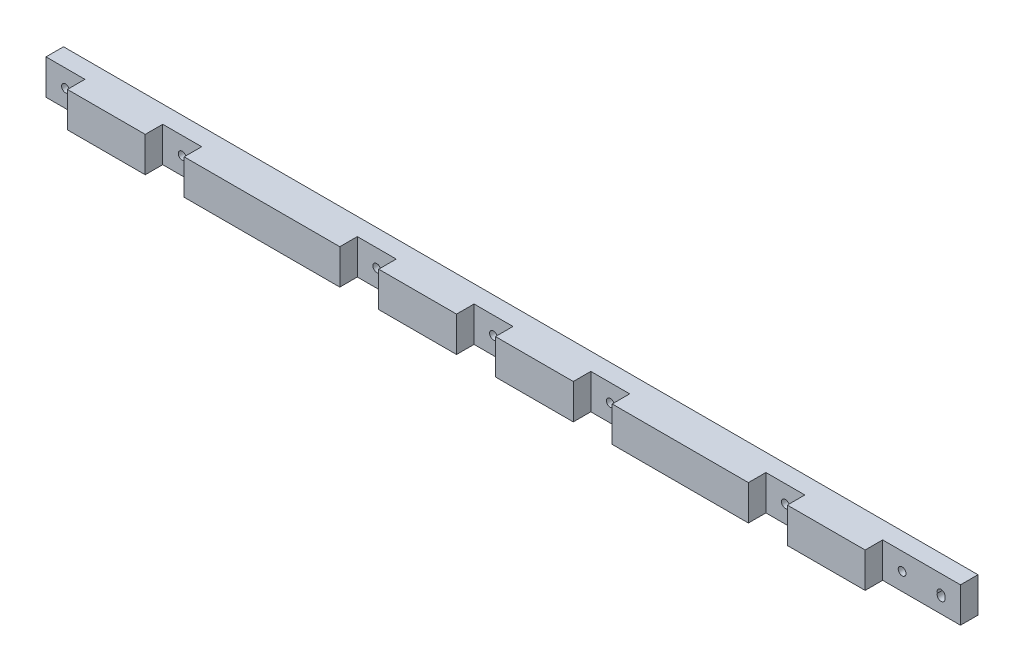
ISO-10303-21;
HEADER;
FILE_DESCRIPTION(('STEP AP214'),'2;1');
FILE_NAME('part.step','',(''),(''),'','','');
FILE_SCHEMA(('AUTOMOTIVE_DESIGN { 1 0 10303 214 1 1 1 1 }'));
ENDSEC;
DATA;
#1=APPLICATION_CONTEXT('core data for automotive mechanical design processes');
#2=APPLICATION_PROTOCOL_DEFINITION('international standard','automotive_design',2000,#1);
#3=PRODUCT_CONTEXT('',#1,'mechanical');
#4=PRODUCT('Part','Part','',(#3));
#5=PRODUCT_RELATED_PRODUCT_CATEGORY('part','',(#4));
#6=PRODUCT_DEFINITION_FORMATION('','',#4);
#7=PRODUCT_DEFINITION_CONTEXT('part definition',#1,'design');
#8=PRODUCT_DEFINITION('design','',#6,#7);
#9=PRODUCT_DEFINITION_SHAPE('','',#8);
#10=(LENGTH_UNIT() NAMED_UNIT(*) SI_UNIT(.MILLI.,.METRE.));
#11=(NAMED_UNIT(*) PLANE_ANGLE_UNIT() SI_UNIT($,.RADIAN.));
#12=(NAMED_UNIT(*) SI_UNIT($,.STERADIAN.) SOLID_ANGLE_UNIT());
#13=UNCERTAINTY_MEASURE_WITH_UNIT(LENGTH_MEASURE(1.E-05),#10,'distance_accuracy_value','');
#14=(GEOMETRIC_REPRESENTATION_CONTEXT(3) GLOBAL_UNCERTAINTY_ASSIGNED_CONTEXT((#13)) GLOBAL_UNIT_ASSIGNED_CONTEXT((#10,
#11,#12)) REPRESENTATION_CONTEXT('',''));
#15=CARTESIAN_POINT('',(0.,0.,0.));
#16=DIRECTION('',(0.,0.,1.));
#17=DIRECTION('',(1.,0.,0.));
#18=AXIS2_PLACEMENT_3D('',#15,#16,#17);
#19=CARTESIAN_POINT('',(0.,9.,9.));
#20=DIRECTION('',(0.,0.,-1.));
#21=DIRECTION('',(-1.,0.,0.));
#22=AXIS2_PLACEMENT_3D('',#19,#20,#21);
#23=PLANE('',#22);
#24=DIRECTION('',(1.,0.,0.));
#25=VECTOR('',#24,1.);
#26=CARTESIAN_POINT('',(0.,0.,9.));
#27=LINE('',#26,#25);
#28=CARTESIAN_POINT('',(195.,0.,9.));
#29=VERTEX_POINT('',#28);
#30=CARTESIAN_POINT('',(215.,0.,9.));
#31=VERTEX_POINT('',#30);
#32=EDGE_CURVE('E462',#29,#31,#27,.T.);
#33=ORIENTED_EDGE('',*,*,#32,.T.);
#34=DIRECTION('',(0.,-1.,0.));
#35=VECTOR('',#34,1.);
#36=CARTESIAN_POINT('',(215.,0.,9.));
#37=LINE('',#36,#35);
#38=CARTESIAN_POINT('',(215.,9.,9.));
#39=VERTEX_POINT('',#38);
#40=EDGE_CURVE('E252',#39,#31,#37,.T.);
#41=ORIENTED_EDGE('',*,*,#40,.F.);
#42=DIRECTION('',(-1.,0.,0.));
#43=VECTOR('',#42,1.);
#44=CARTESIAN_POINT('',(0.,9.,9.));
#45=LINE('',#44,#43);
#46=CARTESIAN_POINT('',(195.,9.,9.));
#47=VERTEX_POINT('',#46);
#48=EDGE_CURVE('E463',#39,#47,#45,.T.);
#49=ORIENTED_EDGE('',*,*,#48,.T.);
#50=DIRECTION('',(0.,1.,0.));
#51=VECTOR('',#50,1.);
#52=CARTESIAN_POINT('',(195.,0.,9.));
#53=LINE('',#52,#51);
#54=EDGE_CURVE('E280',#29,#47,#53,.T.);
#55=ORIENTED_EDGE('',*,*,#54,.F.);
#56=EDGE_LOOP('',(#33,#41,#49,#55));
#57=FACE_BOUND('',#56,.T.);
#58=ADVANCED_FACE('F31',(#57),#23,.F.);
#59=CARTESIAN_POINT('',(150.,0.,9.));
#60=VERTEX_POINT('',#59);
#61=CARTESIAN_POINT('',(185.,0.,9.));
#62=VERTEX_POINT('',#61);
#63=EDGE_CURVE('E563',#60,#62,#27,.T.);
#64=ORIENTED_EDGE('',*,*,#63,.T.);
#65=DIRECTION('',(0.,-1.,0.));
#66=VECTOR('',#65,1.);
#67=CARTESIAN_POINT('',(185.,0.,9.));
#68=LINE('',#67,#66);
#69=CARTESIAN_POINT('',(185.,9.,9.));
#70=VERTEX_POINT('',#69);
#71=EDGE_CURVE('E273',#70,#62,#68,.T.);
#72=ORIENTED_EDGE('',*,*,#71,.F.);
#73=CARTESIAN_POINT('',(150.,9.,9.));
#74=VERTEX_POINT('',#73);
#75=EDGE_CURVE('E466',#70,#74,#45,.T.);
#76=ORIENTED_EDGE('',*,*,#75,.T.);
#77=DIRECTION('',(0.,1.,0.));
#78=VECTOR('',#77,1.);
#79=CARTESIAN_POINT('',(150.,0.,9.));
#80=LINE('',#79,#78);
#81=EDGE_CURVE('E311',#60,#74,#80,.T.);
#82=ORIENTED_EDGE('',*,*,#81,.F.);
#83=EDGE_LOOP('',(#64,#72,#76,#82));
#84=FACE_BOUND('',#83,.T.);
#85=ADVANCED_FACE('F590',(#84),#23,.F.);
#86=CARTESIAN_POINT('',(120.,0.,9.));
#87=VERTEX_POINT('',#86);
#88=CARTESIAN_POINT('',(140.,0.,9.));
#89=VERTEX_POINT('',#88);
#90=EDGE_CURVE('E557',#87,#89,#27,.T.);
#91=ORIENTED_EDGE('',*,*,#90,.T.);
#92=DIRECTION('',(0.,-1.,0.));
#93=VECTOR('',#92,1.);
#94=CARTESIAN_POINT('',(140.,0.,9.));
#95=LINE('',#94,#93);
#96=CARTESIAN_POINT('',(140.,9.,9.));
#97=VERTEX_POINT('',#96);
#98=EDGE_CURVE('E304',#97,#89,#95,.T.);
#99=ORIENTED_EDGE('',*,*,#98,.F.);
#100=CARTESIAN_POINT('',(120.,9.,9.));
#101=VERTEX_POINT('',#100);
#102=EDGE_CURVE('E591',#97,#101,#45,.T.);
#103=ORIENTED_EDGE('',*,*,#102,.T.);
#104=DIRECTION('',(0.,1.,0.));
#105=VECTOR('',#104,1.);
#106=CARTESIAN_POINT('',(120.,0.,9.));
#107=LINE('',#106,#105);
#108=EDGE_CURVE('E344',#87,#101,#107,.T.);
#109=ORIENTED_EDGE('',*,*,#108,.F.);
#110=EDGE_LOOP('',(#91,#99,#103,#109));
#111=FACE_BOUND('',#110,.T.);
#112=ADVANCED_FACE('F604',(#111),#23,.F.);
#113=CARTESIAN_POINT('',(90.,0.,9.));
#114=VERTEX_POINT('',#113);
#115=CARTESIAN_POINT('',(110.,0.,9.));
#116=VERTEX_POINT('',#115);
#117=EDGE_CURVE('E555',#114,#116,#27,.T.);
#118=ORIENTED_EDGE('',*,*,#117,.T.);
#119=DIRECTION('',(0.,-1.,0.));
#120=VECTOR('',#119,1.);
#121=CARTESIAN_POINT('',(110.,0.,9.));
#122=LINE('',#121,#120);
#123=CARTESIAN_POINT('',(110.,9.,9.));
#124=VERTEX_POINT('',#123);
#125=EDGE_CURVE('E337',#124,#116,#122,.T.);
#126=ORIENTED_EDGE('',*,*,#125,.F.);
#127=CARTESIAN_POINT('',(90.,9.,9.));
#128=VERTEX_POINT('',#127);
#129=EDGE_CURVE('E606',#124,#128,#45,.T.);
#130=ORIENTED_EDGE('',*,*,#129,.T.);
#131=DIRECTION('',(0.,1.,0.));
#132=VECTOR('',#131,1.);
#133=CARTESIAN_POINT('',(90.,9.,9.));
#134=LINE('',#133,#132);
#135=EDGE_CURVE('E377',#114,#128,#134,.T.);
#136=ORIENTED_EDGE('',*,*,#135,.F.);
#137=EDGE_LOOP('',(#118,#126,#130,#136));
#138=FACE_BOUND('',#137,.T.);
#139=ADVANCED_FACE('F608',(#138),#23,.F.);
#140=CARTESIAN_POINT('',(40.,0.,9.));
#141=VERTEX_POINT('',#140);
#142=CARTESIAN_POINT('',(80.,0.,9.));
#143=VERTEX_POINT('',#142);
#144=EDGE_CURVE('E461',#141,#143,#27,.T.);
#145=ORIENTED_EDGE('',*,*,#144,.T.);
#146=DIRECTION('',(0.,-1.,0.));
#147=VECTOR('',#146,1.);
#148=CARTESIAN_POINT('',(80.,9.,9.));
#149=LINE('',#148,#147);
#150=CARTESIAN_POINT('',(80.,9.,9.));
#151=VERTEX_POINT('',#150);
#152=EDGE_CURVE('E370',#151,#143,#149,.T.);
#153=ORIENTED_EDGE('',*,*,#152,.F.);
#154=CARTESIAN_POINT('',(40.,9.,9.));
#155=VERTEX_POINT('',#154);
#156=EDGE_CURVE('E545',#151,#155,#45,.T.);
#157=ORIENTED_EDGE('',*,*,#156,.T.);
#158=DIRECTION('',(0.,1.,0.));
#159=VECTOR('',#158,1.);
#160=CARTESIAN_POINT('',(40.,0.,9.));
#161=LINE('',#160,#159);
#162=EDGE_CURVE('E410',#141,#155,#161,.T.);
#163=ORIENTED_EDGE('',*,*,#162,.F.);
#164=EDGE_LOOP('',(#145,#153,#157,#163));
#165=FACE_BOUND('',#164,.T.);
#166=ADVANCED_FACE('F552',(#165),#23,.F.);
#167=CARTESIAN_POINT('',(10.,0.,9.));
#168=VERTEX_POINT('',#167);
#169=CARTESIAN_POINT('',(30.,0.,9.));
#170=VERTEX_POINT('',#169);
#171=EDGE_CURVE('E457',#168,#170,#27,.T.);
#172=ORIENTED_EDGE('',*,*,#171,.T.);
#173=DIRECTION('',(0.,-1.,0.));
#174=VECTOR('',#173,1.);
#175=CARTESIAN_POINT('',(30.,0.,9.));
#176=LINE('',#175,#174);
#177=CARTESIAN_POINT('',(30.,9.,9.));
#178=VERTEX_POINT('',#177);
#179=EDGE_CURVE('E403',#178,#170,#176,.T.);
#180=ORIENTED_EDGE('',*,*,#179,.F.);
#181=CARTESIAN_POINT('',(10.,9.,9.));
#182=VERTEX_POINT('',#181);
#183=EDGE_CURVE('E460',#178,#182,#45,.T.);
#184=ORIENTED_EDGE('',*,*,#183,.T.);
#185=DIRECTION('',(0.,1.,0.));
#186=VECTOR('',#185,1.);
#187=CARTESIAN_POINT('',(10.,0.,9.));
#188=LINE('',#187,#186);
#189=EDGE_CURVE('E436',#168,#182,#188,.T.);
#190=ORIENTED_EDGE('',*,*,#189,.F.);
#191=EDGE_LOOP('',(#172,#180,#184,#190));
#192=FACE_BOUND('',#191,.T.);
#193=ADVANCED_FACE('F534',(#192),#23,.F.);
#194=CARTESIAN_POINT('',(0.,0.,9.));
#195=DIRECTION('',(1.,0.,0.));
#196=DIRECTION('',(0.,0.,-1.));
#197=AXIS2_PLACEMENT_3D('',#194,#195,#196);
#198=PLANE('',#197);
#199=DIRECTION('',(0.,0.,-1.));
#200=VECTOR('',#199,1.);
#201=CARTESIAN_POINT('',(0.,0.,9.));
#202=LINE('',#201,#200);
#203=CARTESIAN_POINT('',(0.,0.,4.5));
#204=VERTEX_POINT('',#203);
#205=CARTESIAN_POINT('',(0.,0.,0.));
#206=VERTEX_POINT('',#205);
#207=EDGE_CURVE('E483',#204,#206,#202,.T.);
#208=ORIENTED_EDGE('',*,*,#207,.F.);
#209=DIRECTION('',(0.,-1.,0.));
#210=VECTOR('',#209,1.);
#211=CARTESIAN_POINT('',(0.,0.,4.5));
#212=LINE('',#211,#210);
#213=CARTESIAN_POINT('',(0.,9.,4.5));
#214=VERTEX_POINT('',#213);
#215=EDGE_CURVE('E439',#214,#204,#212,.T.);
#216=ORIENTED_EDGE('',*,*,#215,.F.);
#217=DIRECTION('',(0.,0.,-1.));
#218=VECTOR('',#217,1.);
#219=CARTESIAN_POINT('',(0.,9.,9.));
#220=LINE('',#219,#218);
#221=CARTESIAN_POINT('',(0.,9.,0.));
#222=VERTEX_POINT('',#221);
#223=EDGE_CURVE('E465',#214,#222,#220,.T.);
#224=ORIENTED_EDGE('',*,*,#223,.T.);
#225=DIRECTION('',(0.,-1.,0.));
#226=VECTOR('',#225,1.);
#227=CARTESIAN_POINT('',(0.,0.,0.));
#228=LINE('',#227,#226);
#229=EDGE_CURVE('E455',#222,#206,#228,.T.);
#230=ORIENTED_EDGE('',*,*,#229,.T.);
#231=EDGE_LOOP('',(#208,#216,#224,#230));
#232=FACE_BOUND('',#231,.T.);
#233=ADVANCED_FACE('F33',(#232),#198,.F.);
#234=CARTESIAN_POINT('',(0.,0.,9.));
#235=DIRECTION('',(0.,1.,0.));
#236=DIRECTION('',(0.,0.,1.));
#237=AXIS2_PLACEMENT_3D('',#234,#235,#236);
#238=PLANE('',#237);
#239=DIRECTION('',(0.,0.,-1.));
#240=VECTOR('',#239,1.);
#241=CARTESIAN_POINT('',(235.,0.,9.));
#242=LINE('',#241,#240);
#243=CARTESIAN_POINT('',(235.,0.,4.5));
#244=VERTEX_POINT('',#243);
#245=CARTESIAN_POINT('',(235.,0.,0.));
#246=VERTEX_POINT('',#245);
#247=EDGE_CURVE('E481',#244,#246,#242,.T.);
#248=ORIENTED_EDGE('',*,*,#247,.F.);
#249=DIRECTION('',(1.,0.,0.));
#250=VECTOR('',#249,1.);
#251=CARTESIAN_POINT('',(215.,0.,4.5));
#252=LINE('',#251,#250);
#253=CARTESIAN_POINT('',(215.,0.,4.5));
#254=VERTEX_POINT('',#253);
#255=EDGE_CURVE('E258',#254,#244,#252,.T.);
#256=ORIENTED_EDGE('',*,*,#255,.F.);
#257=DIRECTION('',(0.,0.,1.));
#258=VECTOR('',#257,1.);
#259=CARTESIAN_POINT('',(215.,0.,4.5));
#260=LINE('',#259,#258);
#261=EDGE_CURVE('E263',#254,#31,#260,.T.);
#262=ORIENTED_EDGE('',*,*,#261,.T.);
#263=ORIENTED_EDGE('',*,*,#32,.F.);
#264=DIRECTION('',(0.,0.,1.));
#265=VECTOR('',#264,1.);
#266=CARTESIAN_POINT('',(195.,0.,4.5));
#267=LINE('',#266,#265);
#268=CARTESIAN_POINT('',(195.,0.,4.5));
#269=VERTEX_POINT('',#268);
#270=EDGE_CURVE('E54',#269,#29,#267,.T.);
#271=ORIENTED_EDGE('',*,*,#270,.F.);
#272=DIRECTION('',(1.,0.,0.));
#273=VECTOR('',#272,1.);
#274=CARTESIAN_POINT('',(185.,0.,4.5));
#275=LINE('',#274,#273);
#276=CARTESIAN_POINT('',(185.,0.,4.5));
#277=VERTEX_POINT('',#276);
#278=EDGE_CURVE('E279',#277,#269,#275,.T.);
#279=ORIENTED_EDGE('',*,*,#278,.F.);
#280=DIRECTION('',(0.,0.,1.));
#281=VECTOR('',#280,1.);
#282=CARTESIAN_POINT('',(185.,0.,4.5));
#283=LINE('',#282,#281);
#284=EDGE_CURVE('E289',#277,#62,#283,.T.);
#285=ORIENTED_EDGE('',*,*,#284,.T.);
#286=ORIENTED_EDGE('',*,*,#63,.F.);
#287=DIRECTION('',(0.,0.,1.));
#288=VECTOR('',#287,1.);
#289=CARTESIAN_POINT('',(150.,0.,4.5));
#290=LINE('',#289,#288);
#291=CARTESIAN_POINT('',(150.,0.,4.5));
#292=VERTEX_POINT('',#291);
#293=EDGE_CURVE('E330',#292,#60,#290,.T.);
#294=ORIENTED_EDGE('',*,*,#293,.F.);
#295=DIRECTION('',(1.,0.,0.));
#296=VECTOR('',#295,1.);
#297=CARTESIAN_POINT('',(140.,0.,4.5));
#298=LINE('',#297,#296);
#299=CARTESIAN_POINT('',(140.,0.,4.5));
#300=VERTEX_POINT('',#299);
#301=EDGE_CURVE('E310',#300,#292,#298,.T.);
#302=ORIENTED_EDGE('',*,*,#301,.F.);
#303=DIRECTION('',(0.,0.,1.));
#304=VECTOR('',#303,1.);
#305=CARTESIAN_POINT('',(140.,0.,4.5));
#306=LINE('',#305,#304);
#307=EDGE_CURVE('E320',#300,#89,#306,.T.);
#308=ORIENTED_EDGE('',*,*,#307,.T.);
#309=ORIENTED_EDGE('',*,*,#90,.F.);
#310=DIRECTION('',(0.,0.,1.));
#311=VECTOR('',#310,1.);
#312=CARTESIAN_POINT('',(120.,0.,4.5));
#313=LINE('',#312,#311);
#314=CARTESIAN_POINT('',(120.,0.,4.5));
#315=VERTEX_POINT('',#314);
#316=EDGE_CURVE('E363',#315,#87,#313,.T.);
#317=ORIENTED_EDGE('',*,*,#316,.F.);
#318=DIRECTION('',(1.,0.,0.));
#319=VECTOR('',#318,1.);
#320=CARTESIAN_POINT('',(110.,0.,4.5));
#321=LINE('',#320,#319);
#322=CARTESIAN_POINT('',(110.,0.,4.5));
#323=VERTEX_POINT('',#322);
#324=EDGE_CURVE('E343',#323,#315,#321,.T.);
#325=ORIENTED_EDGE('',*,*,#324,.F.);
#326=DIRECTION('',(0.,0.,1.));
#327=VECTOR('',#326,1.);
#328=CARTESIAN_POINT('',(110.,0.,4.5));
#329=LINE('',#328,#327);
#330=EDGE_CURVE('E353',#323,#116,#329,.T.);
#331=ORIENTED_EDGE('',*,*,#330,.T.);
#332=ORIENTED_EDGE('',*,*,#117,.F.);
#333=DIRECTION('',(0.,0.,1.));
#334=VECTOR('',#333,1.);
#335=CARTESIAN_POINT('',(90.,0.,4.5));
#336=LINE('',#335,#334);
#337=CARTESIAN_POINT('',(90.,0.,4.5));
#338=VERTEX_POINT('',#337);
#339=EDGE_CURVE('E396',#338,#114,#336,.T.);
#340=ORIENTED_EDGE('',*,*,#339,.F.);
#341=DIRECTION('',(1.,0.,0.));
#342=VECTOR('',#341,1.);
#343=CARTESIAN_POINT('',(80.,0.,4.5));
#344=LINE('',#343,#342);
#345=CARTESIAN_POINT('',(80.,0.,4.5));
#346=VERTEX_POINT('',#345);
#347=EDGE_CURVE('E376',#346,#338,#344,.T.);
#348=ORIENTED_EDGE('',*,*,#347,.F.);
#349=DIRECTION('',(0.,0.,1.));
#350=VECTOR('',#349,1.);
#351=CARTESIAN_POINT('',(80.,0.,4.5));
#352=LINE('',#351,#350);
#353=EDGE_CURVE('E386',#346,#143,#352,.T.);
#354=ORIENTED_EDGE('',*,*,#353,.T.);
#355=ORIENTED_EDGE('',*,*,#144,.F.);
#356=DIRECTION('',(0.,0.,1.));
#357=VECTOR('',#356,1.);
#358=CARTESIAN_POINT('',(40.,0.,4.5));
#359=LINE('',#358,#357);
#360=CARTESIAN_POINT('',(40.,0.,4.5));
#361=VERTEX_POINT('',#360);
#362=EDGE_CURVE('E429',#361,#141,#359,.T.);
#363=ORIENTED_EDGE('',*,*,#362,.F.);
#364=DIRECTION('',(1.,0.,0.));
#365=VECTOR('',#364,1.);
#366=CARTESIAN_POINT('',(30.,0.,4.5));
#367=LINE('',#366,#365);
#368=CARTESIAN_POINT('',(30.,0.,4.5));
#369=VERTEX_POINT('',#368);
#370=EDGE_CURVE('E409',#369,#361,#367,.T.);
#371=ORIENTED_EDGE('',*,*,#370,.F.);
#372=DIRECTION('',(0.,0.,1.));
#373=VECTOR('',#372,1.);
#374=CARTESIAN_POINT('',(30.,0.,4.5));
#375=LINE('',#374,#373);
#376=EDGE_CURVE('E419',#369,#170,#375,.T.);
#377=ORIENTED_EDGE('',*,*,#376,.T.);
#378=ORIENTED_EDGE('',*,*,#171,.F.);
#379=DIRECTION('',(0.,0.,1.));
#380=VECTOR('',#379,1.);
#381=CARTESIAN_POINT('',(10.,0.,4.5));
#382=LINE('',#381,#380);
#383=CARTESIAN_POINT('',(10.,0.,4.5));
#384=VERTEX_POINT('',#383);
#385=EDGE_CURVE('E449',#384,#168,#382,.T.);
#386=ORIENTED_EDGE('',*,*,#385,.F.);
#387=DIRECTION('',(1.,0.,0.));
#388=VECTOR('',#387,1.);
#389=CARTESIAN_POINT('',(0.,0.,4.5));
#390=LINE('',#389,#388);
#391=EDGE_CURVE('E441',#204,#384,#390,.T.);
#392=ORIENTED_EDGE('',*,*,#391,.F.);
#393=ORIENTED_EDGE('',*,*,#207,.T.);
#394=DIRECTION('',(1.,0.,0.));
#395=VECTOR('',#394,1.);
#396=CARTESIAN_POINT('',(0.,0.,0.));
#397=LINE('',#396,#395);
#398=EDGE_CURVE('E469',#206,#246,#397,.T.);
#399=ORIENTED_EDGE('',*,*,#398,.T.);
#400=EDGE_LOOP('',(#248,#256,#262,#263,#271,#279,#285,#286,#294,#302,#308,#309,#317,#325,#331,
#332,#340,#348,#354,#355,#363,#371,#377,#378,#386,#392,#393,#399));
#401=FACE_BOUND('',#400,.T.);
#402=ADVANCED_FACE('F523',(#401),#238,.F.);
#403=CARTESIAN_POINT('',(235.,0.,9.));
#404=DIRECTION('',(-1.,0.,0.));
#405=DIRECTION('',(0.,0.,1.));
#406=AXIS2_PLACEMENT_3D('',#403,#404,#405);
#407=PLANE('',#406);
#408=DIRECTION('',(0.,0.,-1.));
#409=VECTOR('',#408,1.);
#410=CARTESIAN_POINT('',(235.,9.,9.));
#411=LINE('',#410,#409);
#412=CARTESIAN_POINT('',(235.,9.,4.5));
#413=VERTEX_POINT('',#412);
#414=CARTESIAN_POINT('',(235.,9.,0.));
#415=VERTEX_POINT('',#414);
#416=EDGE_CURVE('E479',#413,#415,#411,.T.);
#417=ORIENTED_EDGE('',*,*,#416,.F.);
#418=DIRECTION('',(0.,1.,0.));
#419=VECTOR('',#418,1.);
#420=CARTESIAN_POINT('',(235.,0.,4.5));
#421=LINE('',#420,#419);
#422=EDGE_CURVE('E242',#244,#413,#421,.T.);
#423=ORIENTED_EDGE('',*,*,#422,.F.);
#424=ORIENTED_EDGE('',*,*,#247,.T.);
#425=DIRECTION('',(0.,1.,0.));
#426=VECTOR('',#425,1.);
#427=CARTESIAN_POINT('',(235.,0.,0.));
#428=LINE('',#427,#426);
#429=EDGE_CURVE('E472',#246,#415,#428,.T.);
#430=ORIENTED_EDGE('',*,*,#429,.T.);
#431=EDGE_LOOP('',(#417,#423,#424,#430));
#432=FACE_BOUND('',#431,.T.);
#433=ADVANCED_FACE('F519',(#432),#407,.F.);
#434=CARTESIAN_POINT('',(0.,9.,9.));
#435=DIRECTION('',(0.,-1.,0.));
#436=DIRECTION('',(0.,0.,-1.));
#437=AXIS2_PLACEMENT_3D('',#434,#435,#436);
#438=PLANE('',#437);
#439=DIRECTION('',(-1.,0.,0.));
#440=VECTOR('',#439,1.);
#441=CARTESIAN_POINT('',(215.,9.,4.5));
#442=LINE('',#441,#440);
#443=CARTESIAN_POINT('',(215.,9.,4.5));
#444=VERTEX_POINT('',#443);
#445=EDGE_CURVE('E260',#413,#444,#442,.T.);
#446=ORIENTED_EDGE('',*,*,#445,.F.);
#447=ORIENTED_EDGE('',*,*,#416,.T.);
#448=DIRECTION('',(-1.,0.,0.));
#449=VECTOR('',#448,1.);
#450=CARTESIAN_POINT('',(0.,9.,0.));
#451=LINE('',#450,#449);
#452=EDGE_CURVE('E475',#415,#222,#451,.T.);
#453=ORIENTED_EDGE('',*,*,#452,.T.);
#454=ORIENTED_EDGE('',*,*,#223,.F.);
#455=DIRECTION('',(-1.,0.,0.));
#456=VECTOR('',#455,1.);
#457=CARTESIAN_POINT('',(0.,9.,4.5));
#458=LINE('',#457,#456);
#459=CARTESIAN_POINT('',(10.,9.,4.5));
#460=VERTEX_POINT('',#459);
#461=EDGE_CURVE('E447',#460,#214,#458,.T.);
#462=ORIENTED_EDGE('',*,*,#461,.F.);
#463=DIRECTION('',(0.,0.,1.));
#464=VECTOR('',#463,1.);
#465=CARTESIAN_POINT('',(10.,9.,4.5));
#466=LINE('',#465,#464);
#467=EDGE_CURVE('E452',#460,#182,#466,.T.);
#468=ORIENTED_EDGE('',*,*,#467,.T.);
#469=ORIENTED_EDGE('',*,*,#183,.F.);
#470=DIRECTION('',(0.,0.,1.));
#471=VECTOR('',#470,1.);
#472=CARTESIAN_POINT('',(30.,9.,4.5));
#473=LINE('',#472,#471);
#474=CARTESIAN_POINT('',(30.,9.,4.5));
#475=VERTEX_POINT('',#474);
#476=EDGE_CURVE('E423',#475,#178,#473,.T.);
#477=ORIENTED_EDGE('',*,*,#476,.F.);
#478=DIRECTION('',(-1.,0.,0.));
#479=VECTOR('',#478,1.);
#480=CARTESIAN_POINT('',(30.,9.,4.5));
#481=LINE('',#480,#479);
#482=CARTESIAN_POINT('',(40.,9.,4.5));
#483=VERTEX_POINT('',#482);
#484=EDGE_CURVE('E416',#483,#475,#481,.T.);
#485=ORIENTED_EDGE('',*,*,#484,.F.);
#486=DIRECTION('',(0.,0.,1.));
#487=VECTOR('',#486,1.);
#488=CARTESIAN_POINT('',(40.,9.,4.5));
#489=LINE('',#488,#487);
#490=EDGE_CURVE('E426',#483,#155,#489,.T.);
#491=ORIENTED_EDGE('',*,*,#490,.T.);
#492=ORIENTED_EDGE('',*,*,#156,.F.);
#493=DIRECTION('',(0.,0.,1.));
#494=VECTOR('',#493,1.);
#495=CARTESIAN_POINT('',(80.,9.,4.5));
#496=LINE('',#495,#494);
#497=CARTESIAN_POINT('',(80.,9.,4.5));
#498=VERTEX_POINT('',#497);
#499=EDGE_CURVE('E390',#498,#151,#496,.T.);
#500=ORIENTED_EDGE('',*,*,#499,.F.);
#501=DIRECTION('',(-1.,0.,0.));
#502=VECTOR('',#501,1.);
#503=CARTESIAN_POINT('',(80.,9.,4.5));
#504=LINE('',#503,#502);
#505=CARTESIAN_POINT('',(90.,9.,4.5));
#506=VERTEX_POINT('',#505);
#507=EDGE_CURVE('E383',#506,#498,#504,.T.);
#508=ORIENTED_EDGE('',*,*,#507,.F.);
#509=DIRECTION('',(0.,0.,1.));
#510=VECTOR('',#509,1.);
#511=CARTESIAN_POINT('',(90.,9.,4.5));
#512=LINE('',#511,#510);
#513=EDGE_CURVE('E393',#506,#128,#512,.T.);
#514=ORIENTED_EDGE('',*,*,#513,.T.);
#515=ORIENTED_EDGE('',*,*,#129,.F.);
#516=DIRECTION('',(0.,0.,1.));
#517=VECTOR('',#516,1.);
#518=CARTESIAN_POINT('',(110.,9.,4.5));
#519=LINE('',#518,#517);
#520=CARTESIAN_POINT('',(110.,9.,4.5));
#521=VERTEX_POINT('',#520);
#522=EDGE_CURVE('E357',#521,#124,#519,.T.);
#523=ORIENTED_EDGE('',*,*,#522,.F.);
#524=DIRECTION('',(-1.,0.,0.));
#525=VECTOR('',#524,1.);
#526=CARTESIAN_POINT('',(110.,9.,4.5));
#527=LINE('',#526,#525);
#528=CARTESIAN_POINT('',(120.,9.,4.5));
#529=VERTEX_POINT('',#528);
#530=EDGE_CURVE('E350',#529,#521,#527,.T.);
#531=ORIENTED_EDGE('',*,*,#530,.F.);
#532=DIRECTION('',(0.,0.,1.));
#533=VECTOR('',#532,1.);
#534=CARTESIAN_POINT('',(120.,9.,4.5));
#535=LINE('',#534,#533);
#536=EDGE_CURVE('E360',#529,#101,#535,.T.);
#537=ORIENTED_EDGE('',*,*,#536,.T.);
#538=ORIENTED_EDGE('',*,*,#102,.F.);
#539=DIRECTION('',(0.,0.,1.));
#540=VECTOR('',#539,1.);
#541=CARTESIAN_POINT('',(140.,9.,4.5));
#542=LINE('',#541,#540);
#543=CARTESIAN_POINT('',(140.,9.,4.5));
#544=VERTEX_POINT('',#543);
#545=EDGE_CURVE('E324',#544,#97,#542,.T.);
#546=ORIENTED_EDGE('',*,*,#545,.F.);
#547=DIRECTION('',(-1.,0.,0.));
#548=VECTOR('',#547,1.);
#549=CARTESIAN_POINT('',(140.,9.,4.5));
#550=LINE('',#549,#548);
#551=CARTESIAN_POINT('',(150.,9.,4.5));
#552=VERTEX_POINT('',#551);
#553=EDGE_CURVE('E317',#552,#544,#550,.T.);
#554=ORIENTED_EDGE('',*,*,#553,.F.);
#555=DIRECTION('',(0.,0.,1.));
#556=VECTOR('',#555,1.);
#557=CARTESIAN_POINT('',(150.,9.,4.5));
#558=LINE('',#557,#556);
#559=EDGE_CURVE('E327',#552,#74,#558,.T.);
#560=ORIENTED_EDGE('',*,*,#559,.T.);
#561=ORIENTED_EDGE('',*,*,#75,.F.);
#562=DIRECTION('',(0.,0.,1.));
#563=VECTOR('',#562,1.);
#564=CARTESIAN_POINT('',(185.,9.,4.5));
#565=LINE('',#564,#563);
#566=CARTESIAN_POINT('',(185.,9.,4.5));
#567=VERTEX_POINT('',#566);
#568=EDGE_CURVE('E292',#567,#70,#565,.T.);
#569=ORIENTED_EDGE('',*,*,#568,.F.);
#570=DIRECTION('',(-1.,0.,0.));
#571=VECTOR('',#570,1.);
#572=CARTESIAN_POINT('',(185.,9.,4.5));
#573=LINE('',#572,#571);
#574=CARTESIAN_POINT('',(195.,9.,4.5));
#575=VERTEX_POINT('',#574);
#576=EDGE_CURVE('E286',#575,#567,#573,.T.);
#577=ORIENTED_EDGE('',*,*,#576,.F.);
#578=DIRECTION('',(0.,0.,1.));
#579=VECTOR('',#578,1.);
#580=CARTESIAN_POINT('',(195.,9.,4.5));
#581=LINE('',#580,#579);
#582=EDGE_CURVE('E295',#575,#47,#581,.T.);
#583=ORIENTED_EDGE('',*,*,#582,.T.);
#584=ORIENTED_EDGE('',*,*,#48,.F.);
#585=DIRECTION('',(0.,0.,1.));
#586=VECTOR('',#585,1.);
#587=CARTESIAN_POINT('',(215.,9.,4.5));
#588=LINE('',#587,#586);
#589=EDGE_CURVE('E265',#444,#39,#588,.T.);
#590=ORIENTED_EDGE('',*,*,#589,.F.);
#591=EDGE_LOOP('',(#446,#447,#453,#454,#462,#468,#469,#477,#485,#491,#492,#500,#508,#514,#515,
#523,#531,#537,#538,#546,#554,#560,#561,#569,#577,#583,#584,#590));
#592=FACE_BOUND('',#591,.T.);
#593=ADVANCED_FACE('F489',(#592),#438,.F.);
#594=CARTESIAN_POINT('',(0.,9.,0.));
#595=DIRECTION('',(0.,0.,-1.));
#596=DIRECTION('',(-1.,0.,0.));
#597=AXIS2_PLACEMENT_3D('',#594,#595,#596);
#598=PLANE('',#597);
#599=CARTESIAN_POINT('',(230.,3.8157537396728,0.));
#600=DIRECTION('',(0.,0.,1.));
#601=DIRECTION('',(1.,0.,0.));
#602=AXIS2_PLACEMENT_3D('',#599,#600,#601);
#603=CIRCLE('',#602,0.999999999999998);
#604=CARTESIAN_POINT('',(229.060344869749,4.1578768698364,0.));
#605=VERTEX_POINT('',#604);
#606=CARTESIAN_POINT('',(230.939655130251,4.1578768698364,0.));
#607=VERTEX_POINT('',#606);
#608=EDGE_CURVE('E46',#605,#607,#603,.T.);
#609=ORIENTED_EDGE('',*,*,#608,.T.);
#610=CARTESIAN_POINT('',(230.,4.5,0.));
#611=DIRECTION('',(0.,0.,1.));
#612=DIRECTION('',(1.,0.,0.));
#613=AXIS2_PLACEMENT_3D('',#610,#611,#612);
#614=CIRCLE('',#613,0.999999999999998);
#615=EDGE_CURVE('E238',#607,#605,#614,.T.);
#616=ORIENTED_EDGE('',*,*,#615,.T.);
#617=EDGE_LOOP('',(#609,#616));
#618=FACE_BOUND('',#617,.T.);
#619=CARTESIAN_POINT('',(220.,4.5,0.));
#620=DIRECTION('',(0.,0.,1.));
#621=DIRECTION('',(1.,0.,0.));
#622=AXIS2_PLACEMENT_3D('',#619,#620,#621);
#623=CIRCLE('',#622,0.999999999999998);
#624=CARTESIAN_POINT('',(221.,4.5,0.));
#625=VERTEX_POINT('',#624);
#626=EDGE_CURVE('E249',#625,#625,#623,.T.);
#627=ORIENTED_EDGE('',*,*,#626,.T.);
#628=EDGE_LOOP('',(#627));
#629=FACE_BOUND('',#628,.T.);
#630=CARTESIAN_POINT('',(190.,4.5,0.));
#631=DIRECTION('',(0.,0.,1.));
#632=DIRECTION('',(1.,0.,0.));
#633=AXIS2_PLACEMENT_3D('',#630,#631,#632);
#634=CIRCLE('',#633,0.999999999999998);
#635=CARTESIAN_POINT('',(191.,4.5,0.));
#636=VERTEX_POINT('',#635);
#637=EDGE_CURVE('E270',#636,#636,#634,.T.);
#638=ORIENTED_EDGE('',*,*,#637,.T.);
#639=EDGE_LOOP('',(#638));
#640=FACE_BOUND('',#639,.T.);
#641=CARTESIAN_POINT('',(145.,4.5,0.));
#642=DIRECTION('',(0.,0.,1.));
#643=DIRECTION('',(1.,0.,0.));
#644=AXIS2_PLACEMENT_3D('',#641,#642,#643);
#645=CIRCLE('',#644,0.999999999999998);
#646=CARTESIAN_POINT('',(146.,4.5,0.));
#647=VERTEX_POINT('',#646);
#648=EDGE_CURVE('E301',#647,#647,#645,.T.);
#649=ORIENTED_EDGE('',*,*,#648,.T.);
#650=EDGE_LOOP('',(#649));
#651=FACE_BOUND('',#650,.T.);
#652=CARTESIAN_POINT('',(115.,4.5,0.));
#653=DIRECTION('',(0.,0.,1.));
#654=DIRECTION('',(1.,0.,0.));
#655=AXIS2_PLACEMENT_3D('',#652,#653,#654);
#656=CIRCLE('',#655,0.999999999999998);
#657=CARTESIAN_POINT('',(116.,4.5,0.));
#658=VERTEX_POINT('',#657);
#659=EDGE_CURVE('E334',#658,#658,#656,.T.);
#660=ORIENTED_EDGE('',*,*,#659,.T.);
#661=EDGE_LOOP('',(#660));
#662=FACE_BOUND('',#661,.T.);
#663=CARTESIAN_POINT('',(85.,4.5,0.));
#664=DIRECTION('',(0.,0.,1.));
#665=DIRECTION('',(1.,0.,0.));
#666=AXIS2_PLACEMENT_3D('',#663,#664,#665);
#667=CIRCLE('',#666,0.999999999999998);
#668=CARTESIAN_POINT('',(86.,4.5,0.));
#669=VERTEX_POINT('',#668);
#670=EDGE_CURVE('E367',#669,#669,#667,.T.);
#671=ORIENTED_EDGE('',*,*,#670,.T.);
#672=EDGE_LOOP('',(#671));
#673=FACE_BOUND('',#672,.T.);
#674=CARTESIAN_POINT('',(35.,4.5,0.));
#675=DIRECTION('',(0.,0.,1.));
#676=DIRECTION('',(1.,0.,0.));
#677=AXIS2_PLACEMENT_3D('',#674,#675,#676);
#678=CIRCLE('',#677,0.999999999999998);
#679=CARTESIAN_POINT('',(36.,4.5,0.));
#680=VERTEX_POINT('',#679);
#681=EDGE_CURVE('E400',#680,#680,#678,.T.);
#682=ORIENTED_EDGE('',*,*,#681,.T.);
#683=EDGE_LOOP('',(#682));
#684=FACE_BOUND('',#683,.T.);
#685=CARTESIAN_POINT('',(5.,4.5,0.));
#686=DIRECTION('',(0.,0.,1.));
#687=DIRECTION('',(1.,0.,0.));
#688=AXIS2_PLACEMENT_3D('',#685,#686,#687);
#689=CIRCLE('',#688,1.);
#690=CARTESIAN_POINT('',(6.,4.5,0.));
#691=VERTEX_POINT('',#690);
#692=EDGE_CURVE('E433',#691,#691,#689,.T.);
#693=ORIENTED_EDGE('',*,*,#692,.T.);
#694=EDGE_LOOP('',(#693));
#695=FACE_BOUND('',#694,.T.);
#696=ORIENTED_EDGE('',*,*,#229,.F.);
#697=ORIENTED_EDGE('',*,*,#452,.F.);
#698=ORIENTED_EDGE('',*,*,#429,.F.);
#699=ORIENTED_EDGE('',*,*,#398,.F.);
#700=EDGE_LOOP('',(#696,#697,#698,#699));
#701=FACE_BOUND('',#700,.T.);
#702=ADVANCED_FACE('F485',(#618,#629,#640,#651,#662,#673,#684,#695,#701),#598,.T.);
#703=CARTESIAN_POINT('',(10.,0.,4.5));
#704=DIRECTION('',(1.,0.,0.));
#705=DIRECTION('',(0.,0.,-1.));
#706=AXIS2_PLACEMENT_3D('',#703,#704,#705);
#707=PLANE('',#706);
#708=ORIENTED_EDGE('',*,*,#189,.T.);
#709=ORIENTED_EDGE('',*,*,#467,.F.);
#710=DIRECTION('',(0.,1.,0.));
#711=VECTOR('',#710,1.);
#712=CARTESIAN_POINT('',(10.,0.,4.5));
#713=LINE('',#712,#711);
#714=EDGE_CURVE('E444',#384,#460,#713,.T.);
#715=ORIENTED_EDGE('',*,*,#714,.F.);
#716=ORIENTED_EDGE('',*,*,#385,.T.);
#717=EDGE_LOOP('',(#708,#709,#715,#716));
#718=FACE_BOUND('',#717,.T.);
#719=ADVANCED_FACE('F488',(#718),#707,.F.);
#720=CARTESIAN_POINT('',(0.,9.,4.5));
#721=DIRECTION('',(0.,0.,-1.));
#722=DIRECTION('',(-1.,0.,0.));
#723=AXIS2_PLACEMENT_3D('',#720,#721,#722);
#724=PLANE('',#723);
#725=CARTESIAN_POINT('',(5.,4.5,4.5));
#726=DIRECTION('',(0.,0.,1.));
#727=DIRECTION('',(1.,0.,0.));
#728=AXIS2_PLACEMENT_3D('',#725,#726,#727);
#729=CIRCLE('',#728,1.);
#730=CARTESIAN_POINT('',(6.,4.5,4.5));
#731=VERTEX_POINT('',#730);
#732=EDGE_CURVE('E425',#731,#731,#729,.T.);
#733=ORIENTED_EDGE('',*,*,#732,.F.);
#734=EDGE_LOOP('',(#733));
#735=FACE_BOUND('',#734,.T.);
#736=ORIENTED_EDGE('',*,*,#215,.T.);
#737=ORIENTED_EDGE('',*,*,#391,.T.);
#738=ORIENTED_EDGE('',*,*,#714,.T.);
#739=ORIENTED_EDGE('',*,*,#461,.T.);
#740=EDGE_LOOP('',(#736,#737,#738,#739));
#741=FACE_BOUND('',#740,.T.);
#742=ADVANCED_FACE('F528',(#735,#741),#724,.F.);
#743=CARTESIAN_POINT('',(5.,4.5,0.));
#744=DIRECTION('',(0.,0.,1.));
#745=DIRECTION('',(1.,0.,0.));
#746=AXIS2_PLACEMENT_3D('',#743,#744,#745);
#747=CYLINDRICAL_SURFACE('',#746,1.);
#748=ORIENTED_EDGE('',*,*,#692,.F.);
#749=EDGE_LOOP('',(#748));
#750=FACE_BOUND('',#749,.T.);
#751=ORIENTED_EDGE('',*,*,#732,.T.);
#752=EDGE_LOOP('',(#751));
#753=FACE_BOUND('',#752,.T.);
#754=ADVANCED_FACE('F908',(#750,#753),#747,.F.);
#755=CARTESIAN_POINT('',(30.,0.,4.5));
#756=DIRECTION('',(-1.,0.,0.));
#757=DIRECTION('',(0.,0.,1.));
#758=AXIS2_PLACEMENT_3D('',#755,#756,#757);
#759=PLANE('',#758);
#760=ORIENTED_EDGE('',*,*,#179,.T.);
#761=ORIENTED_EDGE('',*,*,#376,.F.);
#762=DIRECTION('',(0.,-1.,0.));
#763=VECTOR('',#762,1.);
#764=CARTESIAN_POINT('',(30.,0.,4.5));
#765=LINE('',#764,#763);
#766=EDGE_CURVE('E406',#475,#369,#765,.T.);
#767=ORIENTED_EDGE('',*,*,#766,.F.);
#768=ORIENTED_EDGE('',*,*,#476,.T.);
#769=EDGE_LOOP('',(#760,#761,#767,#768));
#770=FACE_BOUND('',#769,.T.);
#771=ADVANCED_FACE('F539',(#770),#759,.F.);
#772=CARTESIAN_POINT('',(40.,0.,4.5));
#773=DIRECTION('',(1.,0.,0.));
#774=DIRECTION('',(0.,0.,-1.));
#775=AXIS2_PLACEMENT_3D('',#772,#773,#774);
#776=PLANE('',#775);
#777=ORIENTED_EDGE('',*,*,#162,.T.);
#778=ORIENTED_EDGE('',*,*,#490,.F.);
#779=DIRECTION('',(0.,1.,0.));
#780=VECTOR('',#779,1.);
#781=CARTESIAN_POINT('',(40.,0.,4.5));
#782=LINE('',#781,#780);
#783=EDGE_CURVE('E413',#361,#483,#782,.T.);
#784=ORIENTED_EDGE('',*,*,#783,.F.);
#785=ORIENTED_EDGE('',*,*,#362,.T.);
#786=EDGE_LOOP('',(#777,#778,#784,#785));
#787=FACE_BOUND('',#786,.T.);
#788=ADVANCED_FACE('F547',(#787),#776,.F.);
#789=CARTESIAN_POINT('',(30.,9.,4.5));
#790=DIRECTION('',(0.,0.,-1.));
#791=DIRECTION('',(-1.,0.,0.));
#792=AXIS2_PLACEMENT_3D('',#789,#790,#791);
#793=PLANE('',#792);
#794=CARTESIAN_POINT('',(35.,4.5,4.5));
#795=DIRECTION('',(0.,0.,1.));
#796=DIRECTION('',(1.,0.,0.));
#797=AXIS2_PLACEMENT_3D('',#794,#795,#796);
#798=CIRCLE('',#797,0.999999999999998);
#799=CARTESIAN_POINT('',(36.,4.5,4.5));
#800=VERTEX_POINT('',#799);
#801=EDGE_CURVE('E392',#800,#800,#798,.T.);
#802=ORIENTED_EDGE('',*,*,#801,.F.);
#803=EDGE_LOOP('',(#802));
#804=FACE_BOUND('',#803,.T.);
#805=ORIENTED_EDGE('',*,*,#766,.T.);
#806=ORIENTED_EDGE('',*,*,#370,.T.);
#807=ORIENTED_EDGE('',*,*,#783,.T.);
#808=ORIENTED_EDGE('',*,*,#484,.T.);
#809=EDGE_LOOP('',(#805,#806,#807,#808));
#810=FACE_BOUND('',#809,.T.);
#811=ADVANCED_FACE('F541',(#804,#810),#793,.F.);
#812=CARTESIAN_POINT('',(35.,4.5,0.));
#813=DIRECTION('',(0.,0.,1.));
#814=DIRECTION('',(1.,0.,0.));
#815=AXIS2_PLACEMENT_3D('',#812,#813,#814);
#816=CYLINDRICAL_SURFACE('',#815,0.999999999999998);
#817=ORIENTED_EDGE('',*,*,#681,.F.);
#818=EDGE_LOOP('',(#817));
#819=FACE_BOUND('',#818,.T.);
#820=ORIENTED_EDGE('',*,*,#801,.T.);
#821=EDGE_LOOP('',(#820));
#822=FACE_BOUND('',#821,.T.);
#823=ADVANCED_FACE('F872',(#819,#822),#816,.F.);
#824=CARTESIAN_POINT('',(80.,9.,4.5));
#825=DIRECTION('',(-1.,0.,0.));
#826=DIRECTION('',(0.,0.,1.));
#827=AXIS2_PLACEMENT_3D('',#824,#825,#826);
#828=PLANE('',#827);
#829=ORIENTED_EDGE('',*,*,#152,.T.);
#830=ORIENTED_EDGE('',*,*,#353,.F.);
#831=DIRECTION('',(0.,-1.,0.));
#832=VECTOR('',#831,1.);
#833=CARTESIAN_POINT('',(80.,9.,4.5));
#834=LINE('',#833,#832);
#835=EDGE_CURVE('E373',#498,#346,#834,.T.);
#836=ORIENTED_EDGE('',*,*,#835,.F.);
#837=ORIENTED_EDGE('',*,*,#499,.T.);
#838=EDGE_LOOP('',(#829,#830,#836,#837));
#839=FACE_BOUND('',#838,.T.);
#840=ADVANCED_FACE('F864',(#839),#828,.F.);
#841=CARTESIAN_POINT('',(90.,9.,4.5));
#842=DIRECTION('',(1.,0.,0.));
#843=DIRECTION('',(0.,0.,-1.));
#844=AXIS2_PLACEMENT_3D('',#841,#842,#843);
#845=PLANE('',#844);
#846=ORIENTED_EDGE('',*,*,#135,.T.);
#847=ORIENTED_EDGE('',*,*,#513,.F.);
#848=DIRECTION('',(0.,1.,0.));
#849=VECTOR('',#848,1.);
#850=CARTESIAN_POINT('',(90.,9.,4.5));
#851=LINE('',#850,#849);
#852=EDGE_CURVE('E380',#338,#506,#851,.T.);
#853=ORIENTED_EDGE('',*,*,#852,.F.);
#854=ORIENTED_EDGE('',*,*,#339,.T.);
#855=EDGE_LOOP('',(#846,#847,#853,#854));
#856=FACE_BOUND('',#855,.T.);
#857=ADVANCED_FACE('F611',(#856),#845,.F.);
#858=CARTESIAN_POINT('',(80.,0.,4.5));
#859=DIRECTION('',(0.,0.,1.));
#860=DIRECTION('',(1.,0.,0.));
#861=AXIS2_PLACEMENT_3D('',#858,#859,#860);
#862=PLANE('',#861);
#863=CARTESIAN_POINT('',(85.,4.5,4.5));
#864=DIRECTION('',(0.,0.,1.));
#865=DIRECTION('',(1.,0.,0.));
#866=AXIS2_PLACEMENT_3D('',#863,#864,#865);
#867=CIRCLE('',#866,0.999999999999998);
#868=CARTESIAN_POINT('',(86.,4.5,4.5));
#869=VERTEX_POINT('',#868);
#870=EDGE_CURVE('E359',#869,#869,#867,.T.);
#871=ORIENTED_EDGE('',*,*,#870,.F.);
#872=EDGE_LOOP('',(#871));
#873=FACE_BOUND('',#872,.T.);
#874=ORIENTED_EDGE('',*,*,#835,.T.);
#875=ORIENTED_EDGE('',*,*,#347,.T.);
#876=ORIENTED_EDGE('',*,*,#852,.T.);
#877=ORIENTED_EDGE('',*,*,#507,.T.);
#878=EDGE_LOOP('',(#874,#875,#876,#877));
#879=FACE_BOUND('',#878,.T.);
#880=ADVANCED_FACE('F615',(#873,#879),#862,.T.);
#881=CARTESIAN_POINT('',(85.,4.5,0.));
#882=DIRECTION('',(0.,0.,1.));
#883=DIRECTION('',(1.,0.,0.));
#884=AXIS2_PLACEMENT_3D('',#881,#882,#883);
#885=CYLINDRICAL_SURFACE('',#884,0.999999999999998);
#886=ORIENTED_EDGE('',*,*,#670,.F.);
#887=EDGE_LOOP('',(#886));
#888=FACE_BOUND('',#887,.T.);
#889=ORIENTED_EDGE('',*,*,#870,.T.);
#890=EDGE_LOOP('',(#889));
#891=FACE_BOUND('',#890,.T.);
#892=ADVANCED_FACE('F632',(#888,#891),#885,.F.);
#893=CARTESIAN_POINT('',(110.,0.,4.5));
#894=DIRECTION('',(-1.,0.,0.));
#895=DIRECTION('',(0.,0.,1.));
#896=AXIS2_PLACEMENT_3D('',#893,#894,#895);
#897=PLANE('',#896);
#898=ORIENTED_EDGE('',*,*,#125,.T.);
#899=ORIENTED_EDGE('',*,*,#330,.F.);
#900=DIRECTION('',(0.,-1.,0.));
#901=VECTOR('',#900,1.);
#902=CARTESIAN_POINT('',(110.,0.,4.5));
#903=LINE('',#902,#901);
#904=EDGE_CURVE('E340',#521,#323,#903,.T.);
#905=ORIENTED_EDGE('',*,*,#904,.F.);
#906=ORIENTED_EDGE('',*,*,#522,.T.);
#907=EDGE_LOOP('',(#898,#899,#905,#906));
#908=FACE_BOUND('',#907,.T.);
#909=ADVANCED_FACE('F618',(#908),#897,.F.);
#910=CARTESIAN_POINT('',(120.,0.,4.5));
#911=DIRECTION('',(1.,0.,0.));
#912=DIRECTION('',(0.,0.,-1.));
#913=AXIS2_PLACEMENT_3D('',#910,#911,#912);
#914=PLANE('',#913);
#915=ORIENTED_EDGE('',*,*,#108,.T.);
#916=ORIENTED_EDGE('',*,*,#536,.F.);
#917=DIRECTION('',(0.,1.,0.));
#918=VECTOR('',#917,1.);
#919=CARTESIAN_POINT('',(120.,0.,4.5));
#920=LINE('',#919,#918);
#921=EDGE_CURVE('E347',#315,#529,#920,.T.);
#922=ORIENTED_EDGE('',*,*,#921,.F.);
#923=ORIENTED_EDGE('',*,*,#316,.T.);
#924=EDGE_LOOP('',(#915,#916,#922,#923));
#925=FACE_BOUND('',#924,.T.);
#926=ADVANCED_FACE('F622',(#925),#914,.F.);
#927=CARTESIAN_POINT('',(110.,9.,4.5));
#928=DIRECTION('',(0.,0.,-1.));
#929=DIRECTION('',(-1.,0.,0.));
#930=AXIS2_PLACEMENT_3D('',#927,#928,#929);
#931=PLANE('',#930);
#932=CARTESIAN_POINT('',(115.,4.5,4.5));
#933=DIRECTION('',(0.,0.,1.));
#934=DIRECTION('',(1.,0.,0.));
#935=AXIS2_PLACEMENT_3D('',#932,#933,#934);
#936=CIRCLE('',#935,0.999999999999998);
#937=CARTESIAN_POINT('',(116.,4.5,4.5));
#938=VERTEX_POINT('',#937);
#939=EDGE_CURVE('E326',#938,#938,#936,.T.);
#940=ORIENTED_EDGE('',*,*,#939,.F.);
#941=EDGE_LOOP('',(#940));
#942=FACE_BOUND('',#941,.T.);
#943=ORIENTED_EDGE('',*,*,#904,.T.);
#944=ORIENTED_EDGE('',*,*,#324,.T.);
#945=ORIENTED_EDGE('',*,*,#921,.T.);
#946=ORIENTED_EDGE('',*,*,#530,.T.);
#947=EDGE_LOOP('',(#943,#944,#945,#946));
#948=FACE_BOUND('',#947,.T.);
#949=ADVANCED_FACE('F620',(#942,#948),#931,.F.);
#950=CARTESIAN_POINT('',(115.,4.5,0.));
#951=DIRECTION('',(0.,0.,1.));
#952=DIRECTION('',(1.,0.,0.));
#953=AXIS2_PLACEMENT_3D('',#950,#951,#952);
#954=CYLINDRICAL_SURFACE('',#953,0.999999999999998);
#955=ORIENTED_EDGE('',*,*,#659,.F.);
#956=EDGE_LOOP('',(#955));
#957=FACE_BOUND('',#956,.T.);
#958=ORIENTED_EDGE('',*,*,#939,.T.);
#959=EDGE_LOOP('',(#958));
#960=FACE_BOUND('',#959,.T.);
#961=ADVANCED_FACE('F629',(#957,#960),#954,.F.);
#962=CARTESIAN_POINT('',(140.,0.,4.5));
#963=DIRECTION('',(-1.,0.,0.));
#964=DIRECTION('',(0.,0.,1.));
#965=AXIS2_PLACEMENT_3D('',#962,#963,#964);
#966=PLANE('',#965);
#967=ORIENTED_EDGE('',*,*,#98,.T.);
#968=ORIENTED_EDGE('',*,*,#307,.F.);
#969=DIRECTION('',(0.,-1.,0.));
#970=VECTOR('',#969,1.);
#971=CARTESIAN_POINT('',(140.,0.,4.5));
#972=LINE('',#971,#970);
#973=EDGE_CURVE('E307',#544,#300,#972,.T.);
#974=ORIENTED_EDGE('',*,*,#973,.F.);
#975=ORIENTED_EDGE('',*,*,#545,.T.);
#976=EDGE_LOOP('',(#967,#968,#974,#975));
#977=FACE_BOUND('',#976,.T.);
#978=ADVANCED_FACE('F603',(#977),#966,.F.);
#979=CARTESIAN_POINT('',(150.,0.,4.5));
#980=DIRECTION('',(1.,0.,0.));
#981=DIRECTION('',(0.,0.,-1.));
#982=AXIS2_PLACEMENT_3D('',#979,#980,#981);
#983=PLANE('',#982);
#984=ORIENTED_EDGE('',*,*,#81,.T.);
#985=ORIENTED_EDGE('',*,*,#559,.F.);
#986=DIRECTION('',(0.,1.,0.));
#987=VECTOR('',#986,1.);
#988=CARTESIAN_POINT('',(150.,0.,4.5));
#989=LINE('',#988,#987);
#990=EDGE_CURVE('E314',#292,#552,#989,.T.);
#991=ORIENTED_EDGE('',*,*,#990,.F.);
#992=ORIENTED_EDGE('',*,*,#293,.T.);
#993=EDGE_LOOP('',(#984,#985,#991,#992));
#994=FACE_BOUND('',#993,.T.);
#995=ADVANCED_FACE('F593',(#994),#983,.F.);
#996=CARTESIAN_POINT('',(140.,9.,4.5));
#997=DIRECTION('',(0.,0.,-1.));
#998=DIRECTION('',(-1.,0.,0.));
#999=AXIS2_PLACEMENT_3D('',#996,#997,#998);
#1000=PLANE('',#999);
#1001=CARTESIAN_POINT('',(145.,4.5,4.5));
#1002=DIRECTION('',(0.,0.,1.));
#1003=DIRECTION('',(1.,0.,0.));
#1004=AXIS2_PLACEMENT_3D('',#1001,#1002,#1003);
#1005=CIRCLE('',#1004,0.999999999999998);
#1006=CARTESIAN_POINT('',(146.,4.5,4.5));
#1007=VERTEX_POINT('',#1006);
#1008=EDGE_CURVE('E294',#1007,#1007,#1005,.T.);
#1009=ORIENTED_EDGE('',*,*,#1008,.F.);
#1010=EDGE_LOOP('',(#1009));
#1011=FACE_BOUND('',#1010,.T.);
#1012=ORIENTED_EDGE('',*,*,#973,.T.);
#1013=ORIENTED_EDGE('',*,*,#301,.T.);
#1014=ORIENTED_EDGE('',*,*,#990,.T.);
#1015=ORIENTED_EDGE('',*,*,#553,.T.);
#1016=EDGE_LOOP('',(#1012,#1013,#1014,#1015));
#1017=FACE_BOUND('',#1016,.T.);
#1018=ADVANCED_FACE('F599',(#1011,#1017),#1000,.F.);
#1019=CARTESIAN_POINT('',(145.,4.5,0.));
#1020=DIRECTION('',(0.,0.,1.));
#1021=DIRECTION('',(1.,0.,0.));
#1022=AXIS2_PLACEMENT_3D('',#1019,#1020,#1021);
#1023=CYLINDRICAL_SURFACE('',#1022,0.999999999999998);
#1024=ORIENTED_EDGE('',*,*,#648,.F.);
#1025=EDGE_LOOP('',(#1024));
#1026=FACE_BOUND('',#1025,.T.);
#1027=ORIENTED_EDGE('',*,*,#1008,.T.);
#1028=EDGE_LOOP('',(#1027));
#1029=FACE_BOUND('',#1028,.T.);
#1030=ADVANCED_FACE('F667',(#1026,#1029),#1023,.F.);
#1031=CARTESIAN_POINT('',(185.,0.,4.5));
#1032=DIRECTION('',(-1.,0.,0.));
#1033=DIRECTION('',(0.,0.,1.));
#1034=AXIS2_PLACEMENT_3D('',#1031,#1032,#1033);
#1035=PLANE('',#1034);
#1036=ORIENTED_EDGE('',*,*,#71,.T.);
#1037=ORIENTED_EDGE('',*,*,#284,.F.);
#1038=DIRECTION('',(0.,-1.,0.));
#1039=VECTOR('',#1038,1.);
#1040=CARTESIAN_POINT('',(185.,0.,4.5));
#1041=LINE('',#1040,#1039);
#1042=EDGE_CURVE('E276',#567,#277,#1041,.T.);
#1043=ORIENTED_EDGE('',*,*,#1042,.F.);
#1044=ORIENTED_EDGE('',*,*,#568,.T.);
#1045=EDGE_LOOP('',(#1036,#1037,#1043,#1044));
#1046=FACE_BOUND('',#1045,.T.);
#1047=ADVANCED_FACE('F589',(#1046),#1035,.F.);
#1048=CARTESIAN_POINT('',(195.,0.,4.5));
#1049=DIRECTION('',(1.,0.,0.));
#1050=DIRECTION('',(0.,0.,-1.));
#1051=AXIS2_PLACEMENT_3D('',#1048,#1049,#1050);
#1052=PLANE('',#1051);
#1053=ORIENTED_EDGE('',*,*,#54,.T.);
#1054=ORIENTED_EDGE('',*,*,#582,.F.);
#1055=DIRECTION('',(0.,1.,0.));
#1056=VECTOR('',#1055,1.);
#1057=CARTESIAN_POINT('',(195.,0.,4.5));
#1058=LINE('',#1057,#1056);
#1059=EDGE_CURVE('E283',#269,#575,#1058,.T.);
#1060=ORIENTED_EDGE('',*,*,#1059,.F.);
#1061=ORIENTED_EDGE('',*,*,#270,.T.);
#1062=EDGE_LOOP('',(#1053,#1054,#1060,#1061));
#1063=FACE_BOUND('',#1062,.T.);
#1064=ADVANCED_FACE('F583',(#1063),#1052,.F.);
#1065=CARTESIAN_POINT('',(185.,9.,4.5));
#1066=DIRECTION('',(0.,0.,-1.));
#1067=DIRECTION('',(-1.,0.,0.));
#1068=AXIS2_PLACEMENT_3D('',#1065,#1066,#1067);
#1069=PLANE('',#1068);
#1070=CARTESIAN_POINT('',(190.,4.5,4.5));
#1071=DIRECTION('',(0.,0.,1.));
#1072=DIRECTION('',(1.,0.,0.));
#1073=AXIS2_PLACEMENT_3D('',#1070,#1071,#1072);
#1074=CIRCLE('',#1073,0.999999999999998);
#1075=CARTESIAN_POINT('',(191.,4.5,4.5));
#1076=VERTEX_POINT('',#1075);
#1077=EDGE_CURVE('E267',#1076,#1076,#1074,.T.);
#1078=ORIENTED_EDGE('',*,*,#1077,.F.);
#1079=EDGE_LOOP('',(#1078));
#1080=FACE_BOUND('',#1079,.T.);
#1081=ORIENTED_EDGE('',*,*,#1042,.T.);
#1082=ORIENTED_EDGE('',*,*,#278,.T.);
#1083=ORIENTED_EDGE('',*,*,#1059,.T.);
#1084=ORIENTED_EDGE('',*,*,#576,.T.);
#1085=EDGE_LOOP('',(#1081,#1082,#1083,#1084));
#1086=FACE_BOUND('',#1085,.T.);
#1087=ADVANCED_FACE('F585',(#1080,#1086),#1069,.F.);
#1088=CARTESIAN_POINT('',(190.,4.5,0.));
#1089=DIRECTION('',(0.,0.,1.));
#1090=DIRECTION('',(1.,0.,0.));
#1091=AXIS2_PLACEMENT_3D('',#1088,#1089,#1090);
#1092=CYLINDRICAL_SURFACE('',#1091,0.999999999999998);
#1093=ORIENTED_EDGE('',*,*,#637,.F.);
#1094=EDGE_LOOP('',(#1093));
#1095=FACE_BOUND('',#1094,.T.);
#1096=ORIENTED_EDGE('',*,*,#1077,.T.);
#1097=EDGE_LOOP('',(#1096));
#1098=FACE_BOUND('',#1097,.T.);
#1099=ADVANCED_FACE('F690',(#1095,#1098),#1092,.F.);
#1100=CARTESIAN_POINT('',(215.,0.,4.5));
#1101=DIRECTION('',(-1.,0.,0.));
#1102=DIRECTION('',(0.,0.,1.));
#1103=AXIS2_PLACEMENT_3D('',#1100,#1101,#1102);
#1104=PLANE('',#1103);
#1105=ORIENTED_EDGE('',*,*,#40,.T.);
#1106=ORIENTED_EDGE('',*,*,#261,.F.);
#1107=DIRECTION('',(0.,-1.,0.));
#1108=VECTOR('',#1107,1.);
#1109=CARTESIAN_POINT('',(215.,0.,4.5));
#1110=LINE('',#1109,#1108);
#1111=EDGE_CURVE('E255',#444,#254,#1110,.T.);
#1112=ORIENTED_EDGE('',*,*,#1111,.F.);
#1113=ORIENTED_EDGE('',*,*,#589,.T.);
#1114=EDGE_LOOP('',(#1105,#1106,#1112,#1113));
#1115=FACE_BOUND('',#1114,.T.);
#1116=ADVANCED_FACE('F580',(#1115),#1104,.F.);
#1117=CARTESIAN_POINT('',(215.,9.,4.5));
#1118=DIRECTION('',(0.,0.,-1.));
#1119=DIRECTION('',(-1.,0.,0.));
#1120=AXIS2_PLACEMENT_3D('',#1117,#1118,#1119);
#1121=PLANE('',#1120);
#1122=CARTESIAN_POINT('',(230.,4.5,4.5));
#1123=DIRECTION('',(0.,0.,1.));
#1124=DIRECTION('',(1.,0.,0.));
#1125=AXIS2_PLACEMENT_3D('',#1122,#1123,#1124);
#1126=CIRCLE('',#1125,0.999999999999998);
#1127=CARTESIAN_POINT('',(230.939655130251,4.1578768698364,4.5));
#1128=VERTEX_POINT('',#1127);
#1129=CARTESIAN_POINT('',(229.060344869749,4.1578768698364,4.5));
#1130=VERTEX_POINT('',#1129);
#1131=EDGE_CURVE('E236',#1128,#1130,#1126,.T.);
#1132=ORIENTED_EDGE('',*,*,#1131,.F.);
#1133=CARTESIAN_POINT('',(230.,3.8157537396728,4.5));
#1134=DIRECTION('',(0.,0.,1.));
#1135=DIRECTION('',(1.,0.,0.));
#1136=AXIS2_PLACEMENT_3D('',#1133,#1134,#1135);
#1137=CIRCLE('',#1136,0.999999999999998);
#1138=EDGE_CURVE('E227',#1130,#1128,#1137,.T.);
#1139=ORIENTED_EDGE('',*,*,#1138,.F.);
#1140=EDGE_LOOP('',(#1132,#1139));
#1141=FACE_BOUND('',#1140,.T.);
#1142=CARTESIAN_POINT('',(220.,4.5,4.5));
#1143=DIRECTION('',(0.,0.,1.));
#1144=DIRECTION('',(1.,0.,0.));
#1145=AXIS2_PLACEMENT_3D('',#1142,#1143,#1144);
#1146=CIRCLE('',#1145,0.999999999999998);
#1147=CARTESIAN_POINT('',(221.,4.5,4.5));
#1148=VERTEX_POINT('',#1147);
#1149=EDGE_CURVE('E248',#1148,#1148,#1146,.T.);
#1150=ORIENTED_EDGE('',*,*,#1149,.F.);
#1151=EDGE_LOOP('',(#1150));
#1152=FACE_BOUND('',#1151,.T.);
#1153=ORIENTED_EDGE('',*,*,#1111,.T.);
#1154=ORIENTED_EDGE('',*,*,#255,.T.);
#1155=ORIENTED_EDGE('',*,*,#422,.T.);
#1156=ORIENTED_EDGE('',*,*,#445,.T.);
#1157=EDGE_LOOP('',(#1153,#1154,#1155,#1156));
#1158=FACE_BOUND('',#1157,.T.);
#1159=ADVANCED_FACE('F239',(#1141,#1152,#1158),#1121,.F.);
#1160=CARTESIAN_POINT('',(220.,4.5,0.));
#1161=DIRECTION('',(0.,0.,1.));
#1162=DIRECTION('',(1.,0.,0.));
#1163=AXIS2_PLACEMENT_3D('',#1160,#1161,#1162);
#1164=CYLINDRICAL_SURFACE('',#1163,0.999999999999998);
#1165=ORIENTED_EDGE('',*,*,#626,.F.);
#1166=EDGE_LOOP('',(#1165));
#1167=FACE_BOUND('',#1166,.T.);
#1168=ORIENTED_EDGE('',*,*,#1149,.T.);
#1169=EDGE_LOOP('',(#1168));
#1170=FACE_BOUND('',#1169,.T.);
#1171=ADVANCED_FACE('F719',(#1167,#1170),#1164,.F.);
#1172=CARTESIAN_POINT('',(230.,4.5,0.));
#1173=DIRECTION('',(0.,0.,1.));
#1174=DIRECTION('',(1.,0.,0.));
#1175=AXIS2_PLACEMENT_3D('',#1172,#1173,#1174);
#1176=CYLINDRICAL_SURFACE('',#1175,0.999999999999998);
#1177=ORIENTED_EDGE('',*,*,#615,.F.);
#1178=DIRECTION('',(0.,0.,1.));
#1179=VECTOR('',#1178,1.);
#1180=CARTESIAN_POINT('',(230.939655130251,4.1578768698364,2.25));
#1181=LINE('',#1180,#1179);
#1182=EDGE_CURVE('E11',#607,#1128,#1181,.T.);
#1183=ORIENTED_EDGE('',*,*,#1182,.T.);
#1184=ORIENTED_EDGE('',*,*,#1131,.T.);
#1185=DIRECTION('',(0.,0.,1.));
#1186=VECTOR('',#1185,1.);
#1187=CARTESIAN_POINT('',(229.060344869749,4.1578768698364,2.25));
#1188=LINE('',#1187,#1186);
#1189=EDGE_CURVE('E39',#1130,#605,#1188,.F.);
#1190=ORIENTED_EDGE('',*,*,#1189,.T.);
#1191=EDGE_LOOP('',(#1177,#1183,#1184,#1190));
#1192=FACE_BOUND('',#1191,.T.);
#1193=ADVANCED_FACE('F235',(#1192),#1176,.F.);
#1194=CARTESIAN_POINT('',(230.,3.8157537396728,0.));
#1195=DIRECTION('',(0.,0.,1.));
#1196=DIRECTION('',(1.,0.,0.));
#1197=AXIS2_PLACEMENT_3D('',#1194,#1195,#1196);
#1198=CYLINDRICAL_SURFACE('',#1197,0.999999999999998);
#1199=ORIENTED_EDGE('',*,*,#608,.F.);
#1200=ORIENTED_EDGE('',*,*,#1189,.F.);
#1201=ORIENTED_EDGE('',*,*,#1138,.T.);
#1202=ORIENTED_EDGE('',*,*,#1182,.F.);
#1203=EDGE_LOOP('',(#1199,#1200,#1201,#1202));
#1204=FACE_BOUND('',#1203,.T.);
#1205=ADVANCED_FACE('F228',(#1204),#1198,.F.);
#1206=CLOSED_SHELL('',(#58,#85,#112,#139,#166,#193,#233,#402,#433,#593,#702,#719,#742,#754,#771,
#788,#811,#823,#840,#857,#880,#892,#909,#926,#949,#961,#978,#995,#1018,#1030,#1047,#1064,#1087,
#1099,#1116,#1159,#1171,#1193,#1205));
#1207=MANIFOLD_SOLID_BREP('B2',#1206);
#1208=ADVANCED_BREP_SHAPE_REPRESENTATION('',(#18,#1207),#14);
#1209=SHAPE_DEFINITION_REPRESENTATION(#9,#1208);
ENDSEC;
END-ISO-10303-21;
